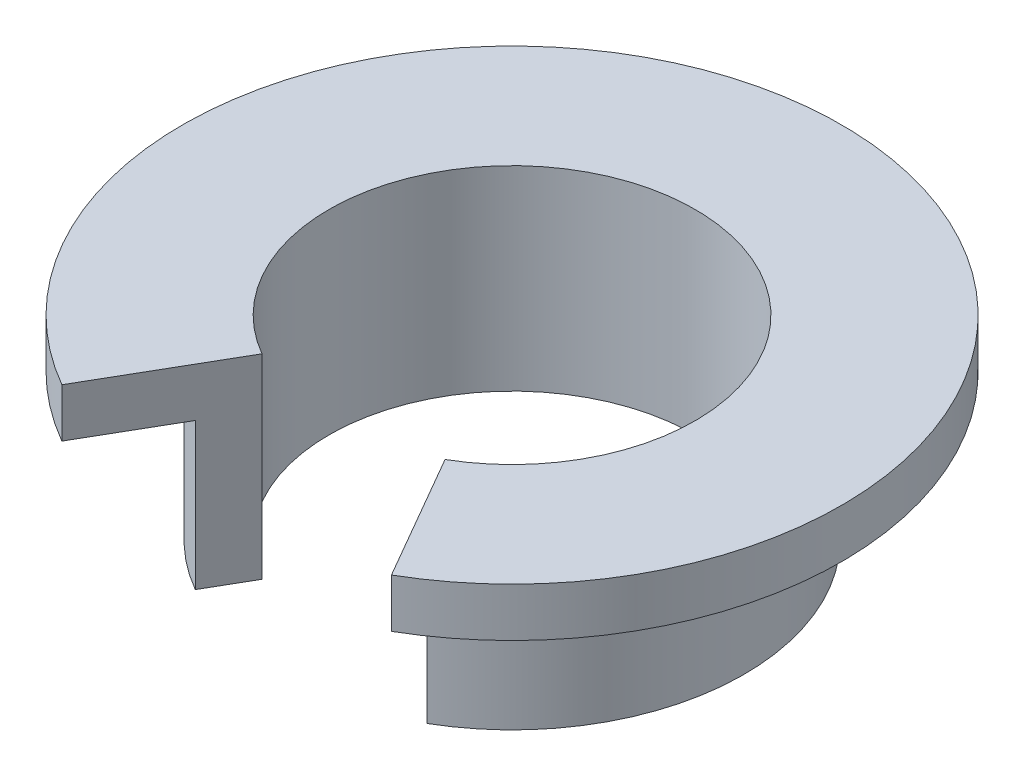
from build123d import *

# Parameters (mm, degrees)
CUT_EXTRUDE1_DEPTH = 10


with BuildPart() as part:
    # Sketch1 → Revolve1 (revolve)
    with BuildSketch(Plane.XY, mode=Mode.PRIVATE) as revolve1_sk:
        Polygon((7.5, 0), (7.5, 8), (13.5, 8), (13.5, 6), (9.5, 6), (9.5, 0), align=None)
    revolve(revolve1_sk.sketch.rotate(Axis((0, 0, 0), (0, 1, 0)), 90), axis=Axis((0, 0, 0), (0, 1, 0)))

    # Sketch2 → Cut-Extrude1 (cut)
    with BuildSketch(Plane(origin=(0, 0, 0), x_dir=(1, 0, 0), z_dir=(0, 1, 0))):
        Polygon((-9.091166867, -15.746362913), (0, 0), (8.625529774, -14.939855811), align=None)
    extrude(amount=CUT_EXTRUDE1_DEPTH, mode=Mode.SUBTRACT)


solid = part.part
